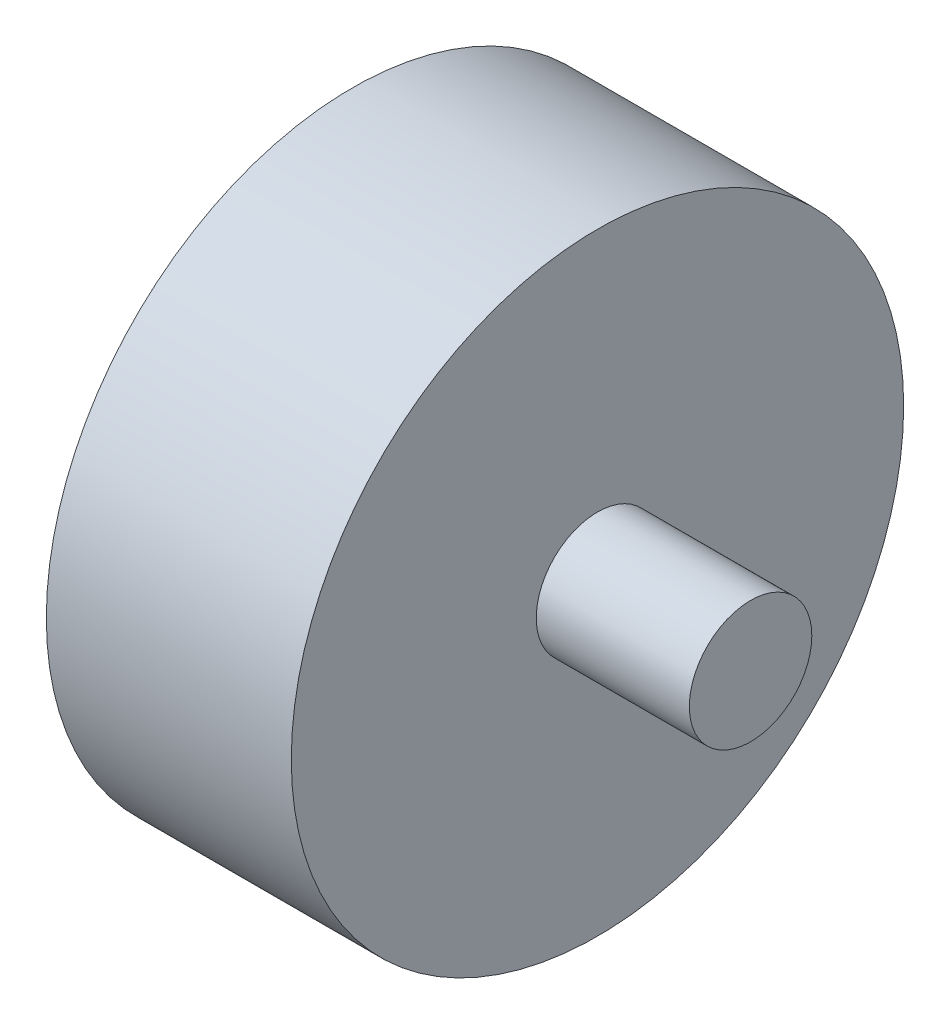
ISO-10303-21;
HEADER;
FILE_DESCRIPTION(('STEP AP214'),'2;1');
FILE_NAME('part.step','',(''),(''),'','','');
FILE_SCHEMA(('AUTOMOTIVE_DESIGN { 1 0 10303 214 1 1 1 1 }'));
ENDSEC;
DATA;
#1=APPLICATION_CONTEXT('core data for automotive mechanical design processes');
#2=APPLICATION_PROTOCOL_DEFINITION('international standard','automotive_design',2000,#1);
#3=PRODUCT_CONTEXT('',#1,'mechanical');
#4=PRODUCT('Part','Part','',(#3));
#5=PRODUCT_RELATED_PRODUCT_CATEGORY('part','',(#4));
#6=PRODUCT_DEFINITION_FORMATION('','',#4);
#7=PRODUCT_DEFINITION_CONTEXT('part definition',#1,'design');
#8=PRODUCT_DEFINITION('design','',#6,#7);
#9=PRODUCT_DEFINITION_SHAPE('','',#8);
#10=(LENGTH_UNIT() NAMED_UNIT(*) SI_UNIT(.MILLI.,.METRE.));
#11=(NAMED_UNIT(*) PLANE_ANGLE_UNIT() SI_UNIT($,.RADIAN.));
#12=(NAMED_UNIT(*) SI_UNIT($,.STERADIAN.) SOLID_ANGLE_UNIT());
#13=UNCERTAINTY_MEASURE_WITH_UNIT(LENGTH_MEASURE(1.E-05),#10,'distance_accuracy_value','');
#14=(GEOMETRIC_REPRESENTATION_CONTEXT(3) GLOBAL_UNCERTAINTY_ASSIGNED_CONTEXT((#13)) GLOBAL_UNIT_ASSIGNED_CONTEXT((#10,
#11,#12)) REPRESENTATION_CONTEXT('',''));
#15=CARTESIAN_POINT('',(0.,0.,0.));
#16=DIRECTION('',(0.,0.,1.));
#17=DIRECTION('',(1.,0.,0.));
#18=AXIS2_PLACEMENT_3D('',#15,#16,#17);
#19=CARTESIAN_POINT('',(-5.08,0.,0.));
#20=DIRECTION('',(1.,0.,0.));
#21=DIRECTION('',(0.,0.,-1.));
#22=AXIS2_PLACEMENT_3D('',#19,#20,#21);
#23=PLANE('',#22);
#24=CARTESIAN_POINT('',(-5.08,0.,0.));
#25=DIRECTION('',(1.,0.,0.));
#26=DIRECTION('',(0.,0.,-1.));
#27=AXIS2_PLACEMENT_3D('',#24,#25,#26);
#28=CIRCLE('',#27,12.7);
#29=CARTESIAN_POINT('',(-5.08,0.,-12.7));
#30=VERTEX_POINT('',#29);
#31=EDGE_CURVE('E36',#30,#30,#28,.T.);
#32=ORIENTED_EDGE('',*,*,#31,.F.);
#33=EDGE_LOOP('',(#32));
#34=FACE_BOUND('',#33,.T.);
#35=CARTESIAN_POINT('',(-5.08,0.,0.));
#36=DIRECTION('',(1.,0.,0.));
#37=DIRECTION('',(0.,0.,-1.));
#38=AXIS2_PLACEMENT_3D('',#35,#36,#37);
#39=CIRCLE('',#38,2.54);
#40=CARTESIAN_POINT('',(-5.08,0.,-2.54));
#41=VERTEX_POINT('',#40);
#42=EDGE_CURVE('E10',#41,#41,#39,.F.);
#43=ORIENTED_EDGE('',*,*,#42,.F.);
#44=EDGE_LOOP('',(#43));
#45=FACE_BOUND('',#44,.T.);
#46=ADVANCED_FACE('F29',(#34,#45),#23,.F.);
#47=CARTESIAN_POINT('',(5.08,0.,0.));
#48=DIRECTION('',(1.,0.,0.));
#49=DIRECTION('',(0.,0.,-1.));
#50=AXIS2_PLACEMENT_3D('',#47,#48,#49);
#51=PLANE('',#50);
#52=CARTESIAN_POINT('',(5.08,0.,0.));
#53=DIRECTION('',(1.,0.,0.));
#54=DIRECTION('',(0.,0.,-1.));
#55=AXIS2_PLACEMENT_3D('',#52,#53,#54);
#56=CIRCLE('',#55,12.7);
#57=CARTESIAN_POINT('',(5.08,0.,-12.7));
#58=VERTEX_POINT('',#57);
#59=EDGE_CURVE('E40',#58,#58,#56,.T.);
#60=ORIENTED_EDGE('',*,*,#59,.T.);
#61=EDGE_LOOP('',(#60));
#62=FACE_BOUND('',#61,.T.);
#63=CARTESIAN_POINT('',(5.08,0.,0.));
#64=DIRECTION('',(1.,0.,0.));
#65=DIRECTION('',(0.,0.,-1.));
#66=AXIS2_PLACEMENT_3D('',#63,#64,#65);
#67=CIRCLE('',#66,2.54);
#68=CARTESIAN_POINT('',(5.08,0.,-2.54));
#69=VERTEX_POINT('',#68);
#70=EDGE_CURVE('E47',#69,#69,#67,.T.);
#71=ORIENTED_EDGE('',*,*,#70,.F.);
#72=EDGE_LOOP('',(#71));
#73=FACE_BOUND('',#72,.T.);
#74=ADVANCED_FACE('F71',(#62,#73),#51,.T.);
#75=CARTESIAN_POINT('',(-5.08,0.,0.));
#76=DIRECTION('',(1.,0.,0.));
#77=DIRECTION('',(0.,0.,-1.));
#78=AXIS2_PLACEMENT_3D('',#75,#76,#77);
#79=CYLINDRICAL_SURFACE('',#78,12.7);
#80=ORIENTED_EDGE('',*,*,#31,.T.);
#81=EDGE_LOOP('',(#80));
#82=FACE_BOUND('',#81,.T.);
#83=ORIENTED_EDGE('',*,*,#59,.F.);
#84=EDGE_LOOP('',(#83));
#85=FACE_BOUND('',#84,.T.);
#86=ADVANCED_FACE('F31',(#82,#85),#79,.T.);
#87=CARTESIAN_POINT('',(11.43,0.,0.));
#88=DIRECTION('',(-1.,0.,0.));
#89=DIRECTION('',(0.,0.,1.));
#90=AXIS2_PLACEMENT_3D('',#87,#88,#89);
#91=CYLINDRICAL_SURFACE('',#90,2.54);
#92=CARTESIAN_POINT('',(11.43,0.,0.));
#93=DIRECTION('',(1.,0.,0.));
#94=DIRECTION('',(0.,0.,-1.));
#95=AXIS2_PLACEMENT_3D('',#92,#93,#94);
#96=CIRCLE('',#95,2.54);
#97=CARTESIAN_POINT('',(11.43,0.,-2.54));
#98=VERTEX_POINT('',#97);
#99=EDGE_CURVE('E44',#98,#98,#96,.T.);
#100=ORIENTED_EDGE('',*,*,#99,.F.);
#101=EDGE_LOOP('',(#100));
#102=FACE_BOUND('',#101,.T.);
#103=ORIENTED_EDGE('',*,*,#70,.T.);
#104=EDGE_LOOP('',(#103));
#105=FACE_BOUND('',#104,.T.);
#106=ADVANCED_FACE('F67',(#102,#105),#91,.T.);
#107=CARTESIAN_POINT('',(11.43,0.,0.));
#108=DIRECTION('',(1.,0.,0.));
#109=DIRECTION('',(0.,0.,-1.));
#110=AXIS2_PLACEMENT_3D('',#107,#108,#109);
#111=PLANE('',#110);
#112=ORIENTED_EDGE('',*,*,#99,.T.);
#113=EDGE_LOOP('',(#112));
#114=FACE_BOUND('',#113,.T.);
#115=ADVANCED_FACE('F60',(#114),#111,.T.);
#116=CARTESIAN_POINT('',(-11.43,0.,0.));
#117=DIRECTION('',(1.,0.,0.));
#118=DIRECTION('',(0.,0.,-1.));
#119=AXIS2_PLACEMENT_3D('',#116,#117,#118);
#120=CYLINDRICAL_SURFACE('',#119,2.54);
#121=CARTESIAN_POINT('',(-11.43,0.,0.));
#122=DIRECTION('',(-1.,0.,0.));
#123=DIRECTION('',(0.,0.,1.));
#124=AXIS2_PLACEMENT_3D('',#121,#122,#123);
#125=CIRCLE('',#124,2.54);
#126=CARTESIAN_POINT('',(-11.43,0.,2.54));
#127=VERTEX_POINT('',#126);
#128=EDGE_CURVE('E50',#127,#127,#125,.T.);
#129=ORIENTED_EDGE('',*,*,#128,.F.);
#130=EDGE_LOOP('',(#129));
#131=FACE_BOUND('',#130,.T.);
#132=ORIENTED_EDGE('',*,*,#42,.T.);
#133=EDGE_LOOP('',(#132));
#134=FACE_BOUND('',#133,.T.);
#135=ADVANCED_FACE('F58',(#131,#134),#120,.T.);
#136=CARTESIAN_POINT('',(-11.43,0.,0.));
#137=DIRECTION('',(-1.,0.,0.));
#138=DIRECTION('',(0.,0.,1.));
#139=AXIS2_PLACEMENT_3D('',#136,#137,#138);
#140=PLANE('',#139);
#141=ORIENTED_EDGE('',*,*,#128,.T.);
#142=EDGE_LOOP('',(#141));
#143=FACE_BOUND('',#142,.T.);
#144=ADVANCED_FACE('F56',(#143),#140,.T.);
#145=CLOSED_SHELL('',(#46,#74,#86,#106,#115,#135,#144));
#146=MANIFOLD_SOLID_BREP('B2',#145);
#147=ADVANCED_BREP_SHAPE_REPRESENTATION('',(#18,#146),#14);
#148=SHAPE_DEFINITION_REPRESENTATION(#9,#147);
ENDSEC;
END-ISO-10303-21;
